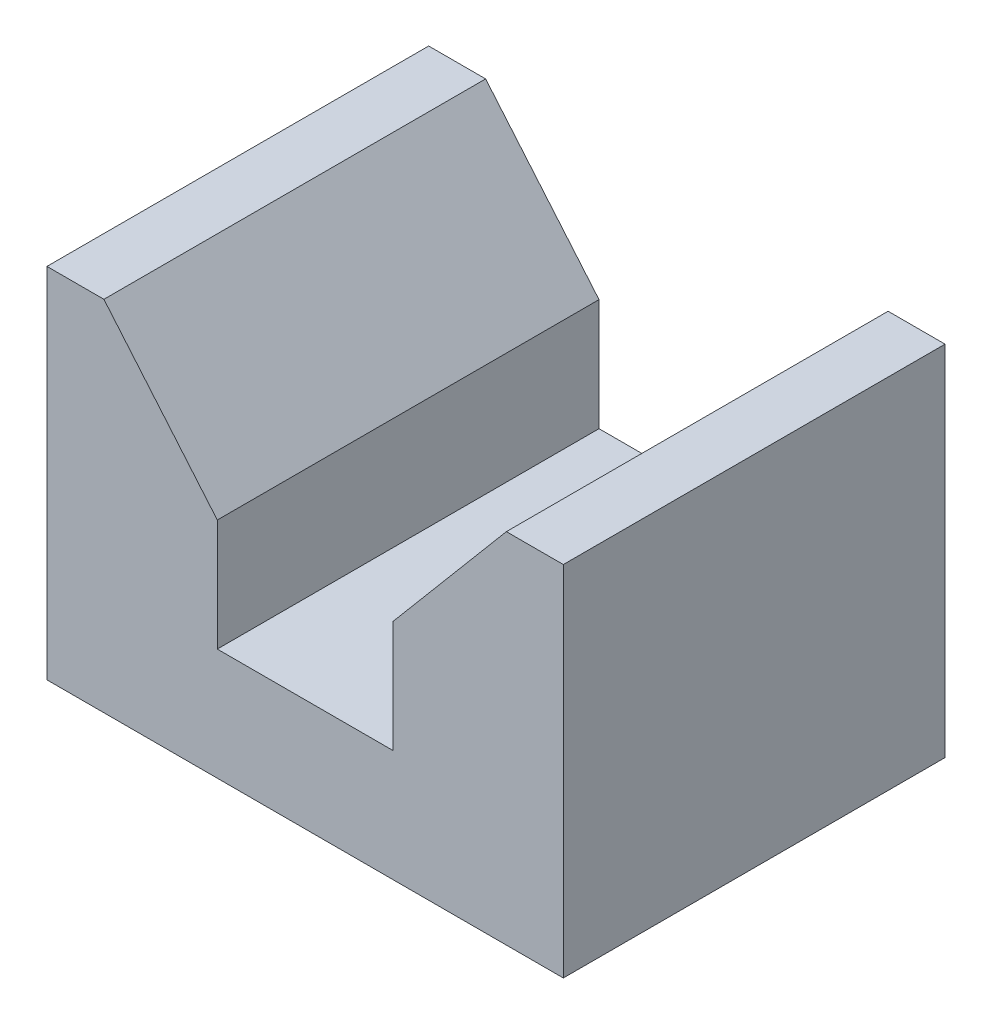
ISO-10303-21;
HEADER;
FILE_DESCRIPTION(('STEP AP214'),'2;1');
FILE_NAME('part.step','',(''),(''),'','','');
FILE_SCHEMA(('AUTOMOTIVE_DESIGN { 1 0 10303 214 1 1 1 1 }'));
ENDSEC;
DATA;
#1=APPLICATION_CONTEXT('core data for automotive mechanical design processes');
#2=APPLICATION_PROTOCOL_DEFINITION('international standard','automotive_design',2000,#1);
#3=PRODUCT_CONTEXT('',#1,'mechanical');
#4=PRODUCT('Part','Part','',(#3));
#5=PRODUCT_RELATED_PRODUCT_CATEGORY('part','',(#4));
#6=PRODUCT_DEFINITION_FORMATION('','',#4);
#7=PRODUCT_DEFINITION_CONTEXT('part definition',#1,'design');
#8=PRODUCT_DEFINITION('design','',#6,#7);
#9=PRODUCT_DEFINITION_SHAPE('','',#8);
#10=(LENGTH_UNIT() NAMED_UNIT(*) SI_UNIT(.MILLI.,.METRE.));
#11=(NAMED_UNIT(*) PLANE_ANGLE_UNIT() SI_UNIT($,.RADIAN.));
#12=(NAMED_UNIT(*) SI_UNIT($,.STERADIAN.) SOLID_ANGLE_UNIT());
#13=UNCERTAINTY_MEASURE_WITH_UNIT(LENGTH_MEASURE(1.E-05),#10,'distance_accuracy_value','');
#14=(GEOMETRIC_REPRESENTATION_CONTEXT(3) GLOBAL_UNCERTAINTY_ASSIGNED_CONTEXT((#13)) GLOBAL_UNIT_ASSIGNED_CONTEXT((#10,
#11,#12)) REPRESENTATION_CONTEXT('',''));
#15=CARTESIAN_POINT('',(0.,0.,0.));
#16=DIRECTION('',(0.,0.,1.));
#17=DIRECTION('',(1.,0.,0.));
#18=AXIS2_PLACEMENT_3D('',#15,#16,#17);
#19=CARTESIAN_POINT('',(-40.5821954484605,0.,30.));
#20=DIRECTION('',(1.,0.,0.));
#21=DIRECTION('',(0.,0.,-1.));
#22=AXIS2_PLACEMENT_3D('',#19,#20,#21);
#23=PLANE('',#22);
#24=DIRECTION('',(0.,-1.,0.));
#25=VECTOR('',#24,1.);
#26=CARTESIAN_POINT('',(-40.5821954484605,0.,-30.));
#27=LINE('',#26,#25);
#28=CARTESIAN_POINT('',(-40.5821954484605,56.283128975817,-30.));
#29=VERTEX_POINT('',#28);
#30=CARTESIAN_POINT('',(-40.5821954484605,0.,-30.));
#31=VERTEX_POINT('',#30);
#32=EDGE_CURVE('E111',#29,#31,#27,.T.);
#33=ORIENTED_EDGE('',*,*,#32,.T.);
#34=DIRECTION('',(0.,0.,-1.));
#35=VECTOR('',#34,1.);
#36=CARTESIAN_POINT('',(-40.5821954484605,0.,30.));
#37=LINE('',#36,#35);
#38=CARTESIAN_POINT('',(-40.5821954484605,0.,30.));
#39=VERTEX_POINT('',#38);
#40=EDGE_CURVE('E11',#39,#31,#37,.T.);
#41=ORIENTED_EDGE('',*,*,#40,.F.);
#42=DIRECTION('',(0.,-1.,0.));
#43=VECTOR('',#42,1.);
#44=CARTESIAN_POINT('',(-40.5821954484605,0.,30.));
#45=LINE('',#44,#43);
#46=CARTESIAN_POINT('',(-40.5821954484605,56.283128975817,30.));
#47=VERTEX_POINT('',#46);
#48=EDGE_CURVE('E142',#47,#39,#45,.T.);
#49=ORIENTED_EDGE('',*,*,#48,.F.);
#50=DIRECTION('',(0.,0.,-1.));
#51=VECTOR('',#50,1.);
#52=CARTESIAN_POINT('',(-40.5821954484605,56.283128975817,30.));
#53=LINE('',#52,#51);
#54=EDGE_CURVE('E124',#47,#29,#53,.T.);
#55=ORIENTED_EDGE('',*,*,#54,.T.);
#56=EDGE_LOOP('',(#33,#41,#49,#55));
#57=FACE_BOUND('',#56,.T.);
#58=ADVANCED_FACE('F31',(#57),#23,.F.);
#59=CARTESIAN_POINT('',(40.5821954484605,0.,30.));
#60=DIRECTION('',(0.,1.,0.));
#61=DIRECTION('',(0.,0.,1.));
#62=AXIS2_PLACEMENT_3D('',#59,#60,#61);
#63=PLANE('',#62);
#64=DIRECTION('',(1.,0.,0.));
#65=VECTOR('',#64,1.);
#66=CARTESIAN_POINT('',(40.5821954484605,0.,-30.));
#67=LINE('',#66,#65);
#68=CARTESIAN_POINT('',(40.5821954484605,0.,-30.));
#69=VERTEX_POINT('',#68);
#70=EDGE_CURVE('E107',#31,#69,#67,.T.);
#71=ORIENTED_EDGE('',*,*,#70,.T.);
#72=DIRECTION('',(0.,0.,-1.));
#73=VECTOR('',#72,1.);
#74=CARTESIAN_POINT('',(40.5821954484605,0.,30.));
#75=LINE('',#74,#73);
#76=CARTESIAN_POINT('',(40.5821954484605,0.,30.));
#77=VERTEX_POINT('',#76);
#78=EDGE_CURVE('E38',#77,#69,#75,.T.);
#79=ORIENTED_EDGE('',*,*,#78,.F.);
#80=DIRECTION('',(1.,0.,0.));
#81=VECTOR('',#80,1.);
#82=CARTESIAN_POINT('',(40.5821954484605,0.,30.));
#83=LINE('',#82,#81);
#84=EDGE_CURVE('E120',#39,#77,#83,.T.);
#85=ORIENTED_EDGE('',*,*,#84,.F.);
#86=ORIENTED_EDGE('',*,*,#40,.T.);
#87=EDGE_LOOP('',(#71,#79,#85,#86));
#88=FACE_BOUND('',#87,.T.);
#89=ADVANCED_FACE('F119',(#88),#63,.F.);
#90=CARTESIAN_POINT('',(40.5821954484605,0.,30.));
#91=DIRECTION('',(-1.,0.,0.));
#92=DIRECTION('',(0.,0.,1.));
#93=AXIS2_PLACEMENT_3D('',#90,#91,#92);
#94=PLANE('',#93);
#95=DIRECTION('',(0.,1.,0.));
#96=VECTOR('',#95,1.);
#97=CARTESIAN_POINT('',(40.5821954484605,0.,-30.));
#98=LINE('',#97,#96);
#99=CARTESIAN_POINT('',(40.5821954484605,56.283128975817,-30.));
#100=VERTEX_POINT('',#99);
#101=EDGE_CURVE('E113',#69,#100,#98,.T.);
#102=ORIENTED_EDGE('',*,*,#101,.T.);
#103=DIRECTION('',(0.,0.,-1.));
#104=VECTOR('',#103,1.);
#105=CARTESIAN_POINT('',(40.5821954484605,56.283128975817,30.));
#106=LINE('',#105,#104);
#107=CARTESIAN_POINT('',(40.5821954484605,56.283128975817,30.));
#108=VERTEX_POINT('',#107);
#109=EDGE_CURVE('E178',#108,#100,#106,.T.);
#110=ORIENTED_EDGE('',*,*,#109,.F.);
#111=DIRECTION('',(0.,1.,0.));
#112=VECTOR('',#111,1.);
#113=CARTESIAN_POINT('',(40.5821954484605,0.,30.));
#114=LINE('',#113,#112);
#115=EDGE_CURVE('E145',#77,#108,#114,.T.);
#116=ORIENTED_EDGE('',*,*,#115,.F.);
#117=ORIENTED_EDGE('',*,*,#78,.T.);
#118=EDGE_LOOP('',(#102,#110,#116,#117));
#119=FACE_BOUND('',#118,.T.);
#120=ADVANCED_FACE('F182',(#119),#94,.F.);
#121=CARTESIAN_POINT('',(40.5821954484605,56.283128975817,30.));
#122=DIRECTION('',(0.,-1.,0.));
#123=DIRECTION('',(0.,0.,-1.));
#124=AXIS2_PLACEMENT_3D('',#121,#122,#123);
#125=PLANE('',#124);
#126=DIRECTION('',(-1.,0.,0.));
#127=VECTOR('',#126,1.);
#128=CARTESIAN_POINT('',(40.5821954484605,56.283128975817,-30.));
#129=LINE('',#128,#127);
#130=CARTESIAN_POINT('',(31.6283338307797,56.283128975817,-30.));
#131=VERTEX_POINT('',#130);
#132=EDGE_CURVE('E128',#100,#131,#129,.T.);
#133=ORIENTED_EDGE('',*,*,#132,.T.);
#134=DIRECTION('',(0.,0.,-1.));
#135=VECTOR('',#134,1.);
#136=CARTESIAN_POINT('',(31.6283338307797,56.283128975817,30.));
#137=LINE('',#136,#135);
#138=CARTESIAN_POINT('',(31.6283338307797,56.283128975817,30.));
#139=VERTEX_POINT('',#138);
#140=EDGE_CURVE('E175',#139,#131,#137,.T.);
#141=ORIENTED_EDGE('',*,*,#140,.F.);
#142=DIRECTION('',(-1.,0.,0.));
#143=VECTOR('',#142,1.);
#144=CARTESIAN_POINT('',(40.5821954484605,56.283128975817,30.));
#145=LINE('',#144,#143);
#146=EDGE_CURVE('E147',#108,#139,#145,.T.);
#147=ORIENTED_EDGE('',*,*,#146,.F.);
#148=ORIENTED_EDGE('',*,*,#109,.T.);
#149=EDGE_LOOP('',(#133,#141,#147,#148));
#150=FACE_BOUND('',#149,.T.);
#151=ADVANCED_FACE('F190',(#150),#125,.F.);
#152=CARTESIAN_POINT('',(31.6283338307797,56.283128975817,30.));
#153=DIRECTION('',(0.764505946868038,-0.644616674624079,0.));
#154=DIRECTION('',(0.644616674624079,0.764505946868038,0.));
#155=AXIS2_PLACEMENT_3D('',#152,#153,#154);
#156=PLANE('',#155);
#157=DIRECTION('',(-0.644616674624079,-0.764505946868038,0.));
#158=VECTOR('',#157,1.);
#159=CARTESIAN_POINT('',(31.6283338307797,56.283128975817,-30.));
#160=LINE('',#159,#158);
#161=CARTESIAN_POINT('',(13.8066995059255,35.1469313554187,-30.));
#162=VERTEX_POINT('',#161);
#163=EDGE_CURVE('E130',#131,#162,#160,.T.);
#164=ORIENTED_EDGE('',*,*,#163,.T.);
#165=DIRECTION('',(0.,0.,-1.));
#166=VECTOR('',#165,1.);
#167=CARTESIAN_POINT('',(13.8066995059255,35.1469313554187,30.));
#168=LINE('',#167,#166);
#169=CARTESIAN_POINT('',(13.8066995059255,35.1469313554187,30.));
#170=VERTEX_POINT('',#169);
#171=EDGE_CURVE('E172',#170,#162,#168,.T.);
#172=ORIENTED_EDGE('',*,*,#171,.F.);
#173=DIRECTION('',(-0.644616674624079,-0.764505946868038,0.));
#174=VECTOR('',#173,1.);
#175=CARTESIAN_POINT('',(31.6283338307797,56.283128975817,30.));
#176=LINE('',#175,#174);
#177=EDGE_CURVE('E149',#139,#170,#176,.T.);
#178=ORIENTED_EDGE('',*,*,#177,.F.);
#179=ORIENTED_EDGE('',*,*,#140,.T.);
#180=EDGE_LOOP('',(#164,#172,#178,#179));
#181=FACE_BOUND('',#180,.T.);
#182=ADVANCED_FACE('F193',(#181),#156,.F.);
#183=CARTESIAN_POINT('',(13.8066995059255,35.1469313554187,30.));
#184=DIRECTION('',(1.,0.,0.));
#185=DIRECTION('',(0.,0.,-1.));
#186=AXIS2_PLACEMENT_3D('',#183,#184,#185);
#187=PLANE('',#186);
#188=DIRECTION('',(0.,-1.,0.));
#189=VECTOR('',#188,1.);
#190=CARTESIAN_POINT('',(13.8066995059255,35.1469313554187,-30.));
#191=LINE('',#190,#189);
#192=CARTESIAN_POINT('',(13.8066995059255,17.5794947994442,-30.));
#193=VERTEX_POINT('',#192);
#194=EDGE_CURVE('E132',#162,#193,#191,.T.);
#195=ORIENTED_EDGE('',*,*,#194,.T.);
#196=DIRECTION('',(0.,0.,-1.));
#197=VECTOR('',#196,1.);
#198=CARTESIAN_POINT('',(13.8066995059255,17.5794947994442,30.));
#199=LINE('',#198,#197);
#200=CARTESIAN_POINT('',(13.8066995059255,17.5794947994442,30.));
#201=VERTEX_POINT('',#200);
#202=EDGE_CURVE('E169',#201,#193,#199,.T.);
#203=ORIENTED_EDGE('',*,*,#202,.F.);
#204=DIRECTION('',(0.,-1.,0.));
#205=VECTOR('',#204,1.);
#206=CARTESIAN_POINT('',(13.8066995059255,35.1469313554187,30.));
#207=LINE('',#206,#205);
#208=EDGE_CURVE('E151',#170,#201,#207,.T.);
#209=ORIENTED_EDGE('',*,*,#208,.F.);
#210=ORIENTED_EDGE('',*,*,#171,.T.);
#211=EDGE_LOOP('',(#195,#203,#209,#210));
#212=FACE_BOUND('',#211,.T.);
#213=ADVANCED_FACE('F198',(#212),#187,.F.);
#214=CARTESIAN_POINT('',(-13.8066995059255,17.5794947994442,30.));
#215=DIRECTION('',(0.,-1.,0.));
#216=DIRECTION('',(0.,0.,-1.));
#217=AXIS2_PLACEMENT_3D('',#214,#215,#216);
#218=PLANE('',#217);
#219=DIRECTION('',(-1.,0.,0.));
#220=VECTOR('',#219,1.);
#221=CARTESIAN_POINT('',(-13.8066995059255,17.5794947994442,-30.));
#222=LINE('',#221,#220);
#223=CARTESIAN_POINT('',(-13.8066995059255,17.5794947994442,-30.));
#224=VERTEX_POINT('',#223);
#225=EDGE_CURVE('E134',#193,#224,#222,.T.);
#226=ORIENTED_EDGE('',*,*,#225,.T.);
#227=DIRECTION('',(0.,0.,-1.));
#228=VECTOR('',#227,1.);
#229=CARTESIAN_POINT('',(-13.8066995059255,17.5794947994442,30.));
#230=LINE('',#229,#228);
#231=CARTESIAN_POINT('',(-13.8066995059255,17.5794947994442,30.));
#232=VERTEX_POINT('',#231);
#233=EDGE_CURVE('E166',#232,#224,#230,.T.);
#234=ORIENTED_EDGE('',*,*,#233,.F.);
#235=DIRECTION('',(-1.,0.,0.));
#236=VECTOR('',#235,1.);
#237=CARTESIAN_POINT('',(-13.8066995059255,17.5794947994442,30.));
#238=LINE('',#237,#236);
#239=EDGE_CURVE('E153',#201,#232,#238,.T.);
#240=ORIENTED_EDGE('',*,*,#239,.F.);
#241=ORIENTED_EDGE('',*,*,#202,.T.);
#242=EDGE_LOOP('',(#226,#234,#240,#241));
#243=FACE_BOUND('',#242,.T.);
#244=ADVANCED_FACE('F204',(#243),#218,.F.);
#245=CARTESIAN_POINT('',(-13.8066995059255,35.1469313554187,30.));
#246=DIRECTION('',(-1.,0.,0.));
#247=DIRECTION('',(0.,0.,1.));
#248=AXIS2_PLACEMENT_3D('',#245,#246,#247);
#249=PLANE('',#248);
#250=DIRECTION('',(0.,1.,0.));
#251=VECTOR('',#250,1.);
#252=CARTESIAN_POINT('',(-13.8066995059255,35.1469313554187,-30.));
#253=LINE('',#252,#251);
#254=CARTESIAN_POINT('',(-13.8066995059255,35.1469313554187,-30.));
#255=VERTEX_POINT('',#254);
#256=EDGE_CURVE('E136',#224,#255,#253,.T.);
#257=ORIENTED_EDGE('',*,*,#256,.T.);
#258=DIRECTION('',(0.,0.,-1.));
#259=VECTOR('',#258,1.);
#260=CARTESIAN_POINT('',(-13.8066995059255,35.1469313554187,30.));
#261=LINE('',#260,#259);
#262=CARTESIAN_POINT('',(-13.8066995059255,35.1469313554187,30.));
#263=VERTEX_POINT('',#262);
#264=EDGE_CURVE('E163',#263,#255,#261,.T.);
#265=ORIENTED_EDGE('',*,*,#264,.F.);
#266=DIRECTION('',(0.,1.,0.));
#267=VECTOR('',#266,1.);
#268=CARTESIAN_POINT('',(-13.8066995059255,35.1469313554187,30.));
#269=LINE('',#268,#267);
#270=EDGE_CURVE('E155',#232,#263,#269,.T.);
#271=ORIENTED_EDGE('',*,*,#270,.F.);
#272=ORIENTED_EDGE('',*,*,#233,.T.);
#273=EDGE_LOOP('',(#257,#265,#271,#272));
#274=FACE_BOUND('',#273,.T.);
#275=ADVANCED_FACE('F208',(#274),#249,.F.);
#276=CARTESIAN_POINT('',(-31.6283338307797,56.283128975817,30.));
#277=DIRECTION('',(-0.764505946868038,-0.644616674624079,0.));
#278=DIRECTION('',(0.644616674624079,-0.764505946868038,0.));
#279=AXIS2_PLACEMENT_3D('',#276,#277,#278);
#280=PLANE('',#279);
#281=DIRECTION('',(-0.644616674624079,0.764505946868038,0.));
#282=VECTOR('',#281,1.);
#283=CARTESIAN_POINT('',(-31.6283338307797,56.283128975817,-30.));
#284=LINE('',#283,#282);
#285=CARTESIAN_POINT('',(-31.6283338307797,56.283128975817,-30.));
#286=VERTEX_POINT('',#285);
#287=EDGE_CURVE('E138',#255,#286,#284,.T.);
#288=ORIENTED_EDGE('',*,*,#287,.T.);
#289=DIRECTION('',(0.,0.,-1.));
#290=VECTOR('',#289,1.);
#291=CARTESIAN_POINT('',(-31.6283338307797,56.283128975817,30.));
#292=LINE('',#291,#290);
#293=CARTESIAN_POINT('',(-31.6283338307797,56.283128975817,30.));
#294=VERTEX_POINT('',#293);
#295=EDGE_CURVE('E160',#294,#286,#292,.T.);
#296=ORIENTED_EDGE('',*,*,#295,.F.);
#297=DIRECTION('',(-0.644616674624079,0.764505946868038,0.));
#298=VECTOR('',#297,1.);
#299=CARTESIAN_POINT('',(-31.6283338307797,56.283128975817,30.));
#300=LINE('',#299,#298);
#301=EDGE_CURVE('E50',#263,#294,#300,.T.);
#302=ORIENTED_EDGE('',*,*,#301,.F.);
#303=ORIENTED_EDGE('',*,*,#264,.T.);
#304=EDGE_LOOP('',(#288,#296,#302,#303));
#305=FACE_BOUND('',#304,.T.);
#306=ADVANCED_FACE('F211',(#305),#280,.F.);
#307=CARTESIAN_POINT('',(-40.5821954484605,56.283128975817,30.));
#308=DIRECTION('',(0.,-1.,0.));
#309=DIRECTION('',(0.,0.,-1.));
#310=AXIS2_PLACEMENT_3D('',#307,#308,#309);
#311=PLANE('',#310);
#312=DIRECTION('',(-1.,0.,0.));
#313=VECTOR('',#312,1.);
#314=CARTESIAN_POINT('',(-40.5821954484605,56.283128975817,-30.));
#315=LINE('',#314,#313);
#316=EDGE_CURVE('E140',#286,#29,#315,.T.);
#317=ORIENTED_EDGE('',*,*,#316,.T.);
#318=ORIENTED_EDGE('',*,*,#54,.F.);
#319=DIRECTION('',(-1.,0.,0.));
#320=VECTOR('',#319,1.);
#321=CARTESIAN_POINT('',(-40.5821954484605,56.283128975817,30.));
#322=LINE('',#321,#320);
#323=EDGE_CURVE('E45',#294,#47,#322,.T.);
#324=ORIENTED_EDGE('',*,*,#323,.F.);
#325=ORIENTED_EDGE('',*,*,#295,.T.);
#326=EDGE_LOOP('',(#317,#318,#324,#325));
#327=FACE_BOUND('',#326,.T.);
#328=ADVANCED_FACE('F213',(#327),#311,.F.);
#329=CARTESIAN_POINT('',(-40.5821954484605,56.283128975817,30.));
#330=DIRECTION('',(0.,0.,-1.));
#331=DIRECTION('',(-1.,0.,0.));
#332=AXIS2_PLACEMENT_3D('',#329,#330,#331);
#333=PLANE('',#332);
#334=ORIENTED_EDGE('',*,*,#48,.T.);
#335=ORIENTED_EDGE('',*,*,#84,.T.);
#336=ORIENTED_EDGE('',*,*,#115,.T.);
#337=ORIENTED_EDGE('',*,*,#146,.T.);
#338=ORIENTED_EDGE('',*,*,#177,.T.);
#339=ORIENTED_EDGE('',*,*,#208,.T.);
#340=ORIENTED_EDGE('',*,*,#239,.T.);
#341=ORIENTED_EDGE('',*,*,#270,.T.);
#342=ORIENTED_EDGE('',*,*,#301,.T.);
#343=ORIENTED_EDGE('',*,*,#323,.T.);
#344=EDGE_LOOP('',(#334,#335,#336,#337,#338,#339,#340,#341,#342,#343));
#345=FACE_BOUND('',#344,.T.);
#346=ADVANCED_FACE('F185',(#345),#333,.F.);
#347=CARTESIAN_POINT('',(-40.5821954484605,56.283128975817,-30.));
#348=DIRECTION('',(0.,0.,-1.));
#349=DIRECTION('',(-1.,0.,0.));
#350=AXIS2_PLACEMENT_3D('',#347,#348,#349);
#351=PLANE('',#350);
#352=ORIENTED_EDGE('',*,*,#32,.F.);
#353=ORIENTED_EDGE('',*,*,#316,.F.);
#354=ORIENTED_EDGE('',*,*,#287,.F.);
#355=ORIENTED_EDGE('',*,*,#256,.F.);
#356=ORIENTED_EDGE('',*,*,#225,.F.);
#357=ORIENTED_EDGE('',*,*,#194,.F.);
#358=ORIENTED_EDGE('',*,*,#163,.F.);
#359=ORIENTED_EDGE('',*,*,#132,.F.);
#360=ORIENTED_EDGE('',*,*,#101,.F.);
#361=ORIENTED_EDGE('',*,*,#70,.F.);
#362=EDGE_LOOP('',(#352,#353,#354,#355,#356,#357,#358,#359,#360,#361));
#363=FACE_BOUND('',#362,.T.);
#364=ADVANCED_FACE('F108',(#363),#351,.T.);
#365=CLOSED_SHELL('',(#58,#89,#120,#151,#182,#213,#244,#275,#306,#328,#346,#364));
#366=MANIFOLD_SOLID_BREP('B2',#365);
#367=ADVANCED_BREP_SHAPE_REPRESENTATION('',(#18,#366),#14);
#368=SHAPE_DEFINITION_REPRESENTATION(#9,#367);
ENDSEC;
END-ISO-10303-21;
